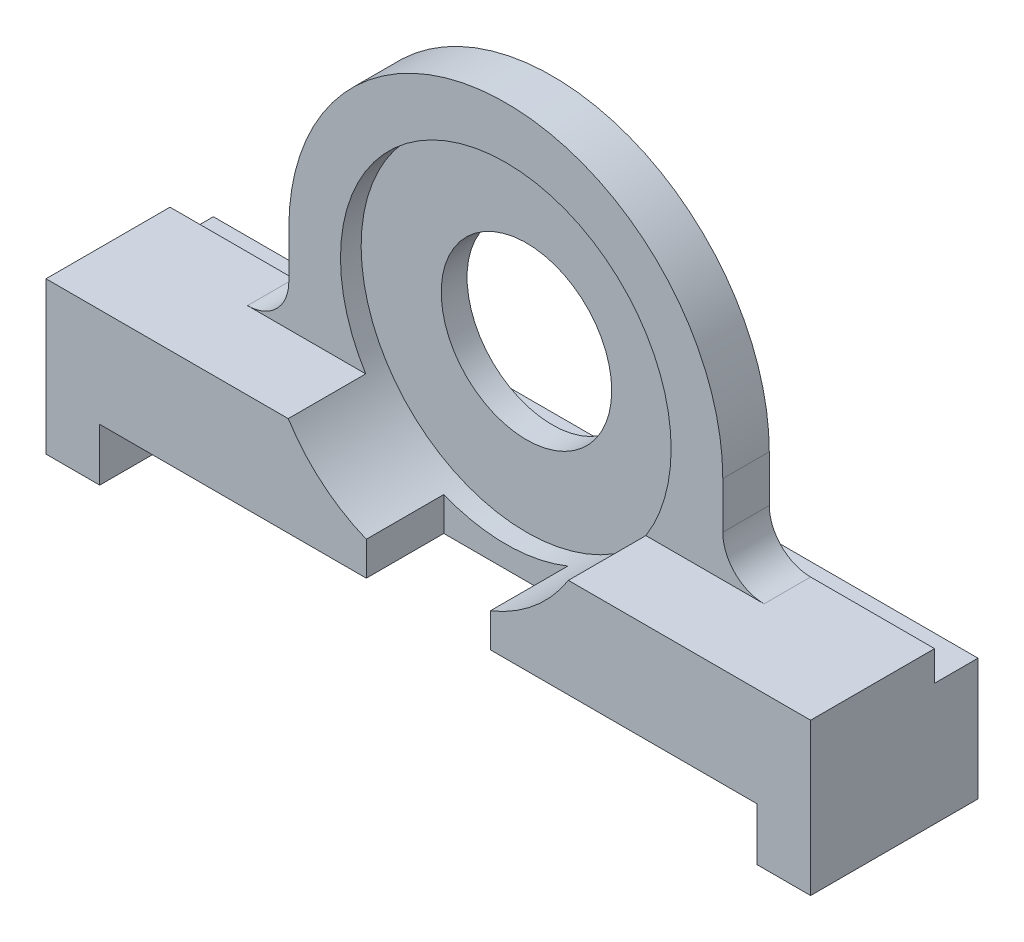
ISO-10303-21;
HEADER;
FILE_DESCRIPTION(('STEP AP214'),'2;1');
FILE_NAME('part.step','',(''),(''),'','','');
FILE_SCHEMA(('AUTOMOTIVE_DESIGN { 1 0 10303 214 1 1 1 1 }'));
ENDSEC;
DATA;
#1=APPLICATION_CONTEXT('core data for automotive mechanical design processes');
#2=APPLICATION_PROTOCOL_DEFINITION('international standard','automotive_design',2000,#1);
#3=PRODUCT_CONTEXT('',#1,'mechanical');
#4=PRODUCT('Part','Part','',(#3));
#5=PRODUCT_RELATED_PRODUCT_CATEGORY('part','',(#4));
#6=PRODUCT_DEFINITION_FORMATION('','',#4);
#7=PRODUCT_DEFINITION_CONTEXT('part definition',#1,'design');
#8=PRODUCT_DEFINITION('design','',#6,#7);
#9=PRODUCT_DEFINITION_SHAPE('','',#8);
#10=(LENGTH_UNIT() NAMED_UNIT(*) SI_UNIT(.MILLI.,.METRE.));
#11=(NAMED_UNIT(*) PLANE_ANGLE_UNIT() SI_UNIT($,.RADIAN.));
#12=(NAMED_UNIT(*) SI_UNIT($,.STERADIAN.) SOLID_ANGLE_UNIT());
#13=UNCERTAINTY_MEASURE_WITH_UNIT(LENGTH_MEASURE(1.E-05),#10,'distance_accuracy_value','');
#14=(GEOMETRIC_REPRESENTATION_CONTEXT(3) GLOBAL_UNCERTAINTY_ASSIGNED_CONTEXT((#13)) GLOBAL_UNIT_ASSIGNED_CONTEXT((#10,
#11,#12)) REPRESENTATION_CONTEXT('',''));
#15=CARTESIAN_POINT('',(0.,0.,0.));
#16=DIRECTION('',(0.,0.,1.));
#17=DIRECTION('',(1.,0.,0.));
#18=AXIS2_PLACEMENT_3D('',#15,#16,#17);
#19=CARTESIAN_POINT('',(0.,23.2,12.));
#20=DIRECTION('',(0.,0.,-1.));
#21=DIRECTION('',(-1.,0.,0.));
#22=AXIS2_PLACEMENT_3D('',#19,#20,#21);
#23=PLANE('',#22);
#24=DIRECTION('',(-1.,0.,0.));
#25=VECTOR('',#24,1.);
#26=CARTESIAN_POINT('',(-21.8,5.1,12.));
#27=LINE('',#26,#25);
#28=CARTESIAN_POINT('',(-6.,5.1,12.));
#29=VERTEX_POINT('',#28);
#30=CARTESIAN_POINT('',(-31.8,5.1,12.));
#31=VERTEX_POINT('',#30);
#32=EDGE_CURVE('E444',#29,#31,#27,.T.);
#33=ORIENTED_EDGE('',*,*,#32,.F.);
#34=DIRECTION('',(0.,-1.,0.));
#35=VECTOR('',#34,1.);
#36=CARTESIAN_POINT('',(-6.,5.1,12.));
#37=LINE('',#36,#35);
#38=CARTESIAN_POINT('',(-6.,8.36760302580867,12.));
#39=VERTEX_POINT('',#38);
#40=EDGE_CURVE('E338',#39,#29,#37,.T.);
#41=ORIENTED_EDGE('',*,*,#40,.F.);
#42=CARTESIAN_POINT('',(0.,23.2,12.));
#43=DIRECTION('',(0.,0.,1.));
#44=DIRECTION('',(1.,0.,0.));
#45=AXIS2_PLACEMENT_3D('',#42,#43,#44);
#46=CIRCLE('',#45,16.);
#47=CARTESIAN_POINT('',(-13.555441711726,14.7,12.));
#48=VERTEX_POINT('',#47);
#49=EDGE_CURVE('E492',#48,#39,#46,.T.);
#50=ORIENTED_EDGE('',*,*,#49,.F.);
#51=DIRECTION('',(-1.,0.,0.));
#52=VECTOR('',#51,1.);
#53=CARTESIAN_POINT('',(-21.,14.7,12.));
#54=LINE('',#53,#52);
#55=CARTESIAN_POINT('',(-37.,14.7,12.));
#56=VERTEX_POINT('',#55);
#57=EDGE_CURVE('E504',#48,#56,#54,.T.);
#58=ORIENTED_EDGE('',*,*,#57,.T.);
#59=DIRECTION('',(0.,-1.,0.));
#60=VECTOR('',#59,1.);
#61=CARTESIAN_POINT('',(-37.,14.7,12.));
#62=LINE('',#61,#60);
#63=CARTESIAN_POINT('',(-37.,0.,12.));
#64=VERTEX_POINT('',#63);
#65=EDGE_CURVE('E506',#56,#64,#62,.T.);
#66=ORIENTED_EDGE('',*,*,#65,.T.);
#67=DIRECTION('',(1.,0.,0.));
#68=VECTOR('',#67,1.);
#69=CARTESIAN_POINT('',(-37.,0.,12.));
#70=LINE('',#69,#68);
#71=CARTESIAN_POINT('',(-31.8,0.,12.));
#72=VERTEX_POINT('',#71);
#73=EDGE_CURVE('E496',#64,#72,#70,.T.);
#74=ORIENTED_EDGE('',*,*,#73,.T.);
#75=DIRECTION('',(0.,-1.,0.));
#76=VECTOR('',#75,1.);
#77=CARTESIAN_POINT('',(-31.8,0.,12.));
#78=LINE('',#77,#76);
#79=EDGE_CURVE('E360',#31,#72,#78,.T.);
#80=ORIENTED_EDGE('',*,*,#79,.F.);
#81=EDGE_LOOP('',(#33,#41,#50,#58,#66,#74,#80));
#82=FACE_BOUND('',#81,.T.);
#83=ADVANCED_FACE('F36',(#82),#23,.F.);
#84=CARTESIAN_POINT('',(21.,23.2,12.));
#85=DIRECTION('',(-1.,0.,0.));
#86=DIRECTION('',(0.,-1.,0.));
#87=AXIS2_PLACEMENT_3D('',#84,#85,#86);
#88=PLANE('',#87);
#89=DIRECTION('',(0.,-1.,0.));
#90=VECTOR('',#89,1.);
#91=CARTESIAN_POINT('',(21.,14.7,4.5));
#92=LINE('',#91,#90);
#93=CARTESIAN_POINT('',(21.,23.2,4.5));
#94=VERTEX_POINT('',#93);
#95=CARTESIAN_POINT('',(21.,18.7,4.5));
#96=VERTEX_POINT('',#95);
#97=EDGE_CURVE('E405',#94,#96,#92,.T.);
#98=ORIENTED_EDGE('',*,*,#97,.T.);
#99=DIRECTION('',(0.,0.,-1.));
#100=VECTOR('',#99,1.);
#101=CARTESIAN_POINT('',(21.,18.7,0.));
#102=LINE('',#101,#100);
#103=CARTESIAN_POINT('',(21.,18.7,0.));
#104=VERTEX_POINT('',#103);
#105=EDGE_CURVE('E559',#96,#104,#102,.T.);
#106=ORIENTED_EDGE('',*,*,#105,.T.);
#107=DIRECTION('',(0.,1.,0.));
#108=VECTOR('',#107,1.);
#109=CARTESIAN_POINT('',(21.,23.2,0.));
#110=LINE('',#109,#108);
#111=CARTESIAN_POINT('',(21.,23.2,0.));
#112=VERTEX_POINT('',#111);
#113=EDGE_CURVE('E513',#104,#112,#110,.T.);
#114=ORIENTED_EDGE('',*,*,#113,.T.);
#115=DIRECTION('',(0.,0.,-1.));
#116=VECTOR('',#115,1.);
#117=CARTESIAN_POINT('',(21.,23.2,12.));
#118=LINE('',#117,#116);
#119=EDGE_CURVE('E531',#94,#112,#118,.T.);
#120=ORIENTED_EDGE('',*,*,#119,.F.);
#121=EDGE_LOOP('',(#98,#106,#114,#120));
#122=FACE_BOUND('',#121,.T.);
#123=ADVANCED_FACE('F595',(#122),#88,.F.);
#124=CARTESIAN_POINT('',(0.,23.2,12.));
#125=DIRECTION('',(0.,0.,-1.));
#126=DIRECTION('',(-1.,0.,0.));
#127=AXIS2_PLACEMENT_3D('',#124,#125,#126);
#128=CYLINDRICAL_SURFACE('',#127,21.);
#129=CARTESIAN_POINT('',(0.,23.2,4.5));
#130=DIRECTION('',(0.,0.,1.));
#131=DIRECTION('',(1.,0.,0.));
#132=AXIS2_PLACEMENT_3D('',#129,#130,#131);
#133=CIRCLE('',#132,21.);
#134=CARTESIAN_POINT('',(-21.,23.2,4.5));
#135=VERTEX_POINT('',#134);
#136=EDGE_CURVE('E379',#135,#94,#133,.F.);
#137=ORIENTED_EDGE('',*,*,#136,.T.);
#138=ORIENTED_EDGE('',*,*,#119,.T.);
#139=CARTESIAN_POINT('',(0.,23.2,0.));
#140=DIRECTION('',(0.,0.,1.));
#141=DIRECTION('',(-1.,0.,0.));
#142=AXIS2_PLACEMENT_3D('',#139,#140,#141);
#143=CIRCLE('',#142,21.);
#144=CARTESIAN_POINT('',(-21.,23.2,0.));
#145=VERTEX_POINT('',#144);
#146=EDGE_CURVE('E515',#112,#145,#143,.T.);
#147=ORIENTED_EDGE('',*,*,#146,.T.);
#148=DIRECTION('',(0.,0.,-1.));
#149=VECTOR('',#148,1.);
#150=CARTESIAN_POINT('',(-21.,23.2,12.));
#151=LINE('',#150,#149);
#152=EDGE_CURVE('E529',#135,#145,#151,.T.);
#153=ORIENTED_EDGE('',*,*,#152,.F.);
#154=EDGE_LOOP('',(#137,#138,#147,#153));
#155=FACE_BOUND('',#154,.T.);
#156=ADVANCED_FACE('F591',(#155),#128,.T.);
#157=CARTESIAN_POINT('',(-21.,14.7,12.));
#158=DIRECTION('',(1.,0.,0.));
#159=DIRECTION('',(0.,0.,-1.));
#160=AXIS2_PLACEMENT_3D('',#157,#158,#159);
#161=PLANE('',#160);
#162=DIRECTION('',(0.,-1.,0.));
#163=VECTOR('',#162,1.);
#164=CARTESIAN_POINT('',(-21.,14.7,0.));
#165=LINE('',#164,#163);
#166=CARTESIAN_POINT('',(-21.,18.7,0.));
#167=VERTEX_POINT('',#166);
#168=EDGE_CURVE('E518',#145,#167,#165,.T.);
#169=ORIENTED_EDGE('',*,*,#168,.T.);
#170=DIRECTION('',(0.,0.,-1.));
#171=VECTOR('',#170,1.);
#172=CARTESIAN_POINT('',(-21.,18.7,4.5));
#173=LINE('',#172,#171);
#174=CARTESIAN_POINT('',(-21.,18.7,4.5));
#175=VERTEX_POINT('',#174);
#176=EDGE_CURVE('E568',#167,#175,#173,.F.);
#177=ORIENTED_EDGE('',*,*,#176,.T.);
#178=DIRECTION('',(0.,1.,0.));
#179=VECTOR('',#178,1.);
#180=CARTESIAN_POINT('',(-21.,23.2,4.5));
#181=LINE('',#180,#179);
#182=EDGE_CURVE('E399',#175,#135,#181,.T.);
#183=ORIENTED_EDGE('',*,*,#182,.T.);
#184=ORIENTED_EDGE('',*,*,#152,.T.);
#185=EDGE_LOOP('',(#169,#177,#183,#184));
#186=FACE_BOUND('',#185,.T.);
#187=ADVANCED_FACE('F582',(#186),#161,.F.);
#188=CARTESIAN_POINT('',(37.,0.,12.));
#189=DIRECTION('',(0.,1.,0.));
#190=DIRECTION('',(-1.,0.,0.));
#191=AXIS2_PLACEMENT_3D('',#188,#189,#190);
#192=PLANE('',#191);
#193=CARTESIAN_POINT('',(-34.,0.,3.));
#194=DIRECTION('',(0.,-1.,0.));
#195=DIRECTION('',(1.,0.,0.));
#196=AXIS2_PLACEMENT_3D('',#193,#194,#195);
#197=CIRCLE('',#196,1.25);
#198=CARTESIAN_POINT('',(-32.75,0.,3.));
#199=VERTEX_POINT('',#198);
#200=EDGE_CURVE('E413',#199,#199,#197,.T.);
#201=ORIENTED_EDGE('',*,*,#200,.F.);
#202=EDGE_LOOP('',(#201));
#203=FACE_BOUND('',#202,.T.);
#204=CARTESIAN_POINT('',(-34.,0.,9.));
#205=DIRECTION('',(0.,-1.,0.));
#206=DIRECTION('',(1.,0.,0.));
#207=AXIS2_PLACEMENT_3D('',#204,#205,#206);
#208=CIRCLE('',#207,1.25);
#209=CARTESIAN_POINT('',(-32.75,0.,9.));
#210=VERTEX_POINT('',#209);
#211=EDGE_CURVE('E412',#210,#210,#208,.T.);
#212=ORIENTED_EDGE('',*,*,#211,.F.);
#213=EDGE_LOOP('',(#212));
#214=FACE_BOUND('',#213,.T.);
#215=DIRECTION('',(1.,0.,0.));
#216=VECTOR('',#215,1.);
#217=CARTESIAN_POINT('',(-21.8,0.,5.));
#218=LINE('',#217,#216);
#219=CARTESIAN_POINT('',(-31.8,0.,5.));
#220=VERTEX_POINT('',#219);
#221=CARTESIAN_POINT('',(-21.8,0.,5.));
#222=VERTEX_POINT('',#221);
#223=EDGE_CURVE('E381',#220,#222,#218,.T.);
#224=ORIENTED_EDGE('',*,*,#223,.F.);
#225=DIRECTION('',(0.,0.,1.));
#226=VECTOR('',#225,1.);
#227=CARTESIAN_POINT('',(-31.8,0.,5.));
#228=LINE('',#227,#226);
#229=EDGE_CURVE('E375',#220,#72,#228,.T.);
#230=ORIENTED_EDGE('',*,*,#229,.T.);
#231=ORIENTED_EDGE('',*,*,#73,.F.);
#232=DIRECTION('',(0.,0.,-1.));
#233=VECTOR('',#232,1.);
#234=CARTESIAN_POINT('',(-37.,0.,12.));
#235=LINE('',#234,#233);
#236=CARTESIAN_POINT('',(-37.,0.,-4.2));
#237=VERTEX_POINT('',#236);
#238=EDGE_CURVE('E508',#64,#237,#235,.T.);
#239=ORIENTED_EDGE('',*,*,#238,.T.);
#240=DIRECTION('',(-1.,0.,0.));
#241=VECTOR('',#240,1.);
#242=CARTESIAN_POINT('',(-37.,0.,-4.2));
#243=LINE('',#242,#241);
#244=CARTESIAN_POINT('',(-33.88,0.,-4.2));
#245=VERTEX_POINT('',#244);
#246=EDGE_CURVE('E327',#245,#237,#243,.T.);
#247=ORIENTED_EDGE('',*,*,#246,.F.);
#248=DIRECTION('',(0.,0.,-1.));
#249=VECTOR('',#248,1.);
#250=CARTESIAN_POINT('',(-33.88,0.,1.));
#251=LINE('',#250,#249);
#252=CARTESIAN_POINT('',(-33.88,0.,1.));
#253=VERTEX_POINT('',#252);
#254=EDGE_CURVE('E483',#253,#245,#251,.T.);
#255=ORIENTED_EDGE('',*,*,#254,.F.);
#256=DIRECTION('',(1.,0.,0.));
#257=VECTOR('',#256,1.);
#258=CARTESIAN_POINT('',(-33.88,0.,1.));
#259=LINE('',#258,#257);
#260=CARTESIAN_POINT('',(-21.8,0.,1.));
#261=VERTEX_POINT('',#260);
#262=EDGE_CURVE('E457',#253,#261,#259,.T.);
#263=ORIENTED_EDGE('',*,*,#262,.T.);
#264=DIRECTION('',(0.,0.,-1.));
#265=VECTOR('',#264,1.);
#266=CARTESIAN_POINT('',(-21.8,0.,12.001));
#267=LINE('',#266,#265);
#268=EDGE_CURVE('E442',#222,#261,#267,.T.);
#269=ORIENTED_EDGE('',*,*,#268,.F.);
#270=EDGE_LOOP('',(#224,#230,#231,#239,#247,#255,#263,#269));
#271=FACE_BOUND('',#270,.T.);
#272=ADVANCED_FACE('F694',(#203,#214,#271),#192,.F.);
#273=CARTESIAN_POINT('',(0.,23.2,0.));
#274=DIRECTION('',(0.,0.,-1.));
#275=DIRECTION('',(-1.,0.,0.));
#276=AXIS2_PLACEMENT_3D('',#273,#274,#275);
#277=PLANE('',#276);
#278=DIRECTION('',(1.,0.,0.));
#279=VECTOR('',#278,1.);
#280=CARTESIAN_POINT('',(37.,11.8,0.));
#281=LINE('',#280,#279);
#282=CARTESIAN_POINT('',(-37.,11.8,0.));
#283=VERTEX_POINT('',#282);
#284=CARTESIAN_POINT('',(37.,11.8,0.));
#285=VERTEX_POINT('',#284);
#286=EDGE_CURVE('E51',#283,#285,#281,.T.);
#287=ORIENTED_EDGE('',*,*,#286,.F.);
#288=DIRECTION('',(0.,-1.,0.));
#289=VECTOR('',#288,1.);
#290=CARTESIAN_POINT('',(-37.,14.7,0.));
#291=LINE('',#290,#289);
#292=CARTESIAN_POINT('',(-37.,14.7,0.));
#293=VERTEX_POINT('',#292);
#294=EDGE_CURVE('E523',#293,#283,#291,.T.);
#295=ORIENTED_EDGE('',*,*,#294,.F.);
#296=DIRECTION('',(-1.,0.,0.));
#297=VECTOR('',#296,1.);
#298=CARTESIAN_POINT('',(-21.,14.7,0.));
#299=LINE('',#298,#297);
#300=CARTESIAN_POINT('',(-25.,14.7,0.));
#301=VERTEX_POINT('',#300);
#302=EDGE_CURVE('E521',#301,#293,#299,.T.);
#303=ORIENTED_EDGE('',*,*,#302,.F.);
#304=CARTESIAN_POINT('',(-25.,18.7,0.));
#305=DIRECTION('',(0.,0.,-1.));
#306=DIRECTION('',(-1.,0.,0.));
#307=AXIS2_PLACEMENT_3D('',#304,#305,#306);
#308=CIRCLE('',#307,4.);
#309=EDGE_CURVE('E44',#301,#167,#308,.F.);
#310=ORIENTED_EDGE('',*,*,#309,.T.);
#311=ORIENTED_EDGE('',*,*,#168,.F.);
#312=ORIENTED_EDGE('',*,*,#146,.F.);
#313=ORIENTED_EDGE('',*,*,#113,.F.);
#314=CARTESIAN_POINT('',(25.,18.7,0.));
#315=DIRECTION('',(0.,0.,-1.));
#316=DIRECTION('',(-1.,0.,0.));
#317=AXIS2_PLACEMENT_3D('',#314,#315,#316);
#318=CIRCLE('',#317,4.);
#319=CARTESIAN_POINT('',(25.,14.7,0.));
#320=VERTEX_POINT('',#319);
#321=EDGE_CURVE('E570',#104,#320,#318,.F.);
#322=ORIENTED_EDGE('',*,*,#321,.T.);
#323=DIRECTION('',(-1.,0.,0.));
#324=VECTOR('',#323,1.);
#325=CARTESIAN_POINT('',(21.,14.7,0.));
#326=LINE('',#325,#324);
#327=CARTESIAN_POINT('',(37.,14.7,0.));
#328=VERTEX_POINT('',#327);
#329=EDGE_CURVE('E510',#328,#320,#326,.T.);
#330=ORIENTED_EDGE('',*,*,#329,.F.);
#331=DIRECTION('',(0.,1.,0.));
#332=VECTOR('',#331,1.);
#333=CARTESIAN_POINT('',(37.,14.7,0.));
#334=LINE('',#333,#332);
#335=EDGE_CURVE('E495',#285,#328,#334,.T.);
#336=ORIENTED_EDGE('',*,*,#335,.F.);
#337=EDGE_LOOP('',(#287,#295,#303,#310,#311,#312,#313,#322,#330,#336));
#338=FACE_BOUND('',#337,.T.);
#339=CARTESIAN_POINT('',(0.,23.2,0.));
#340=DIRECTION('',(0.,0.,1.));
#341=DIRECTION('',(1.,0.,0.));
#342=AXIS2_PLACEMENT_3D('',#339,#340,#341);
#343=CIRCLE('',#342,8.25);
#344=CARTESIAN_POINT('',(8.25,23.2,0.));
#345=VERTEX_POINT('',#344);
#346=EDGE_CURVE('E485',#345,#345,#343,.T.);
#347=ORIENTED_EDGE('',*,*,#346,.T.);
#348=EDGE_LOOP('',(#347));
#349=FACE_BOUND('',#348,.T.);
#350=ADVANCED_FACE('F575',(#338,#349),#277,.T.);
#351=CARTESIAN_POINT('',(34.,0.,9.));
#352=DIRECTION('',(0.,-1.,0.));
#353=DIRECTION('',(-1.,0.,0.));
#354=AXIS2_PLACEMENT_3D('',#351,#352,#353);
#355=CIRCLE('',#354,1.25);
#356=CARTESIAN_POINT('',(32.75,0.,9.));
#357=VERTEX_POINT('',#356);
#358=EDGE_CURVE('E408',#357,#357,#355,.T.);
#359=ORIENTED_EDGE('',*,*,#358,.F.);
#360=EDGE_LOOP('',(#359));
#361=FACE_BOUND('',#360,.T.);
#362=CARTESIAN_POINT('',(34.,0.,3.));
#363=DIRECTION('',(0.,-1.,0.));
#364=DIRECTION('',(-1.,0.,0.));
#365=AXIS2_PLACEMENT_3D('',#362,#363,#364);
#366=CIRCLE('',#365,1.25);
#367=CARTESIAN_POINT('',(32.75,0.,3.));
#368=VERTEX_POINT('',#367);
#369=EDGE_CURVE('E419',#368,#368,#366,.T.);
#370=ORIENTED_EDGE('',*,*,#369,.F.);
#371=EDGE_LOOP('',(#370));
#372=FACE_BOUND('',#371,.T.);
#373=CARTESIAN_POINT('',(31.8,0.,12.));
#374=VERTEX_POINT('',#373);
#375=CARTESIAN_POINT('',(37.,0.,12.));
#376=VERTEX_POINT('',#375);
#377=EDGE_CURVE('E499',#374,#376,#70,.T.);
#378=ORIENTED_EDGE('',*,*,#377,.F.);
#379=DIRECTION('',(0.,0.,1.));
#380=VECTOR('',#379,1.);
#381=CARTESIAN_POINT('',(31.8,0.,5.));
#382=LINE('',#381,#380);
#383=CARTESIAN_POINT('',(31.8,0.,5.));
#384=VERTEX_POINT('',#383);
#385=EDGE_CURVE('E372',#384,#374,#382,.T.);
#386=ORIENTED_EDGE('',*,*,#385,.F.);
#387=DIRECTION('',(1.,0.,0.));
#388=VECTOR('',#387,1.);
#389=CARTESIAN_POINT('',(21.8,0.,5.));
#390=LINE('',#389,#388);
#391=CARTESIAN_POINT('',(21.8,0.,5.));
#392=VERTEX_POINT('',#391);
#393=EDGE_CURVE('E363',#392,#384,#390,.T.);
#394=ORIENTED_EDGE('',*,*,#393,.F.);
#395=DIRECTION('',(0.,0.,-1.));
#396=VECTOR('',#395,1.);
#397=CARTESIAN_POINT('',(21.8,0.,12.001));
#398=LINE('',#397,#396);
#399=CARTESIAN_POINT('',(21.8,0.,1.));
#400=VERTEX_POINT('',#399);
#401=EDGE_CURVE('E445',#392,#400,#398,.T.);
#402=ORIENTED_EDGE('',*,*,#401,.T.);
#403=CARTESIAN_POINT('',(33.88,0.,1.));
#404=VERTEX_POINT('',#403);
#405=EDGE_CURVE('E456',#400,#404,#259,.T.);
#406=ORIENTED_EDGE('',*,*,#405,.T.);
#407=DIRECTION('',(0.,0.,-1.));
#408=VECTOR('',#407,1.);
#409=CARTESIAN_POINT('',(33.88,0.,1.));
#410=LINE('',#409,#408);
#411=CARTESIAN_POINT('',(33.88,0.,-4.2));
#412=VERTEX_POINT('',#411);
#413=EDGE_CURVE('E289',#404,#412,#410,.T.);
#414=ORIENTED_EDGE('',*,*,#413,.T.);
#415=DIRECTION('',(-1.,0.,0.));
#416=VECTOR('',#415,1.);
#417=CARTESIAN_POINT('',(33.88,0.,-4.2));
#418=LINE('',#417,#416);
#419=CARTESIAN_POINT('',(37.,0.,-4.2));
#420=VERTEX_POINT('',#419);
#421=EDGE_CURVE('E286',#420,#412,#418,.T.);
#422=ORIENTED_EDGE('',*,*,#421,.F.);
#423=DIRECTION('',(0.,0.,-1.));
#424=VECTOR('',#423,1.);
#425=CARTESIAN_POINT('',(37.,0.,12.));
#426=LINE('',#425,#424);
#427=EDGE_CURVE('E272',#376,#420,#426,.T.);
#428=ORIENTED_EDGE('',*,*,#427,.F.);
#429=EDGE_LOOP('',(#378,#386,#394,#402,#406,#414,#422,#428));
#430=FACE_BOUND('',#429,.T.);
#431=ADVANCED_FACE('F287',(#361,#372,#430),#192,.F.);
#432=CARTESIAN_POINT('',(6.,8.36760302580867,12.));
#433=VERTEX_POINT('',#432);
#434=CARTESIAN_POINT('',(13.555441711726,14.7,12.));
#435=VERTEX_POINT('',#434);
#436=EDGE_CURVE('E489',#433,#435,#46,.T.);
#437=ORIENTED_EDGE('',*,*,#436,.F.);
#438=DIRECTION('',(0.,1.,0.));
#439=VECTOR('',#438,1.);
#440=CARTESIAN_POINT('',(6.,5.1,12.));
#441=LINE('',#440,#439);
#442=CARTESIAN_POINT('',(6.,5.1,12.));
#443=VERTEX_POINT('',#442);
#444=EDGE_CURVE('E346',#443,#433,#441,.T.);
#445=ORIENTED_EDGE('',*,*,#444,.F.);
#446=CARTESIAN_POINT('',(31.8,5.1,12.));
#447=VERTEX_POINT('',#446);
#448=EDGE_CURVE('E450',#447,#443,#27,.T.);
#449=ORIENTED_EDGE('',*,*,#448,.F.);
#450=DIRECTION('',(0.,1.,0.));
#451=VECTOR('',#450,1.);
#452=CARTESIAN_POINT('',(31.8,0.,12.));
#453=LINE('',#452,#451);
#454=EDGE_CURVE('E364',#374,#447,#453,.T.);
#455=ORIENTED_EDGE('',*,*,#454,.F.);
#456=ORIENTED_EDGE('',*,*,#377,.T.);
#457=DIRECTION('',(0.,1.,0.));
#458=VECTOR('',#457,1.);
#459=CARTESIAN_POINT('',(37.,14.7,12.));
#460=LINE('',#459,#458);
#461=CARTESIAN_POINT('',(37.,14.7,12.));
#462=VERTEX_POINT('',#461);
#463=EDGE_CURVE('E279',#376,#462,#460,.T.);
#464=ORIENTED_EDGE('',*,*,#463,.T.);
#465=DIRECTION('',(-1.,0.,0.));
#466=VECTOR('',#465,1.);
#467=CARTESIAN_POINT('',(21.,14.7,12.));
#468=LINE('',#467,#466);
#469=EDGE_CURVE('E501',#462,#435,#468,.T.);
#470=ORIENTED_EDGE('',*,*,#469,.T.);
#471=EDGE_LOOP('',(#437,#445,#449,#455,#456,#464,#470));
#472=FACE_BOUND('',#471,.T.);
#473=ADVANCED_FACE('F624',(#472),#23,.F.);
#474=CARTESIAN_POINT('',(37.,14.7,12.));
#475=DIRECTION('',(-1.,0.,0.));
#476=DIRECTION('',(0.,0.,1.));
#477=AXIS2_PLACEMENT_3D('',#474,#475,#476);
#478=PLANE('',#477);
#479=ORIENTED_EDGE('',*,*,#427,.T.);
#480=DIRECTION('',(0.,-1.,0.));
#481=VECTOR('',#480,1.);
#482=CARTESIAN_POINT('',(37.,11.8,-4.2));
#483=LINE('',#482,#481);
#484=CARTESIAN_POINT('',(37.,11.8,-4.2));
#485=VERTEX_POINT('',#484);
#486=EDGE_CURVE('E277',#485,#420,#483,.T.);
#487=ORIENTED_EDGE('',*,*,#486,.F.);
#488=DIRECTION('',(0.,0.,1.));
#489=VECTOR('',#488,1.);
#490=CARTESIAN_POINT('',(37.,11.8,-4.2));
#491=LINE('',#490,#489);
#492=EDGE_CURVE('E332',#485,#285,#491,.T.);
#493=ORIENTED_EDGE('',*,*,#492,.T.);
#494=ORIENTED_EDGE('',*,*,#335,.T.);
#495=DIRECTION('',(0.,0.,-1.));
#496=VECTOR('',#495,1.);
#497=CARTESIAN_POINT('',(37.,14.7,12.));
#498=LINE('',#497,#496);
#499=EDGE_CURVE('E283',#462,#328,#498,.T.);
#500=ORIENTED_EDGE('',*,*,#499,.F.);
#501=ORIENTED_EDGE('',*,*,#463,.F.);
#502=EDGE_LOOP('',(#479,#487,#493,#494,#500,#501));
#503=FACE_BOUND('',#502,.T.);
#504=ADVANCED_FACE('F274',(#503),#478,.F.);
#505=CARTESIAN_POINT('',(21.,14.7,12.));
#506=DIRECTION('',(0.,-1.,0.));
#507=DIRECTION('',(1.,0.,0.));
#508=AXIS2_PLACEMENT_3D('',#505,#506,#507);
#509=PLANE('',#508);
#510=ORIENTED_EDGE('',*,*,#329,.T.);
#511=DIRECTION('',(0.,0.,-1.));
#512=VECTOR('',#511,1.);
#513=CARTESIAN_POINT('',(25.,14.7,4.5));
#514=LINE('',#513,#512);
#515=CARTESIAN_POINT('',(25.,14.7,4.5));
#516=VERTEX_POINT('',#515);
#517=EDGE_CURVE('E562',#320,#516,#514,.F.);
#518=ORIENTED_EDGE('',*,*,#517,.T.);
#519=DIRECTION('',(-1.,0.,0.));
#520=VECTOR('',#519,1.);
#521=CARTESIAN_POINT('',(-21.,14.7,4.5));
#522=LINE('',#521,#520);
#523=CARTESIAN_POINT('',(13.555441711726,14.7,4.5));
#524=VERTEX_POINT('',#523);
#525=EDGE_CURVE('E402',#516,#524,#522,.T.);
#526=ORIENTED_EDGE('',*,*,#525,.T.);
#527=DIRECTION('',(0.,0.,-1.));
#528=VECTOR('',#527,1.);
#529=CARTESIAN_POINT('',(13.555441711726,14.7,12.));
#530=LINE('',#529,#528);
#531=EDGE_CURVE('E541',#524,#435,#530,.F.);
#532=ORIENTED_EDGE('',*,*,#531,.T.);
#533=ORIENTED_EDGE('',*,*,#469,.F.);
#534=ORIENTED_EDGE('',*,*,#499,.T.);
#535=EDGE_LOOP('',(#510,#518,#526,#532,#533,#534));
#536=FACE_BOUND('',#535,.T.);
#537=ADVANCED_FACE('F602',(#536),#509,.F.);
#538=CARTESIAN_POINT('',(-21.,14.7,12.));
#539=DIRECTION('',(0.,-1.,0.));
#540=DIRECTION('',(1.,0.,0.));
#541=AXIS2_PLACEMENT_3D('',#538,#539,#540);
#542=PLANE('',#541);
#543=CARTESIAN_POINT('',(-13.555441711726,14.7,4.5));
#544=VERTEX_POINT('',#543);
#545=CARTESIAN_POINT('',(-25.,14.7,4.5));
#546=VERTEX_POINT('',#545);
#547=EDGE_CURVE('E401',#544,#546,#522,.T.);
#548=ORIENTED_EDGE('',*,*,#547,.T.);
#549=DIRECTION('',(0.,0.,-1.));
#550=VECTOR('',#549,1.);
#551=CARTESIAN_POINT('',(-25.,14.7,0.));
#552=LINE('',#551,#550);
#553=EDGE_CURVE('E565',#546,#301,#552,.T.);
#554=ORIENTED_EDGE('',*,*,#553,.T.);
#555=ORIENTED_EDGE('',*,*,#302,.T.);
#556=DIRECTION('',(0.,0.,-1.));
#557=VECTOR('',#556,1.);
#558=CARTESIAN_POINT('',(-37.,14.7,12.));
#559=LINE('',#558,#557);
#560=EDGE_CURVE('E526',#56,#293,#559,.T.);
#561=ORIENTED_EDGE('',*,*,#560,.F.);
#562=ORIENTED_EDGE('',*,*,#57,.F.);
#563=DIRECTION('',(0.,0.,-1.));
#564=VECTOR('',#563,1.);
#565=CARTESIAN_POINT('',(-13.555441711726,14.7,12.));
#566=LINE('',#565,#564);
#567=EDGE_CURVE('E544',#48,#544,#566,.T.);
#568=ORIENTED_EDGE('',*,*,#567,.T.);
#569=EDGE_LOOP('',(#548,#554,#555,#561,#562,#568));
#570=FACE_BOUND('',#569,.T.);
#571=ADVANCED_FACE('F615',(#570),#542,.F.);
#572=CARTESIAN_POINT('',(-37.,14.7,12.));
#573=DIRECTION('',(1.,0.,0.));
#574=DIRECTION('',(0.,0.,-1.));
#575=AXIS2_PLACEMENT_3D('',#572,#573,#574);
#576=PLANE('',#575);
#577=ORIENTED_EDGE('',*,*,#294,.T.);
#578=DIRECTION('',(0.,0.,1.));
#579=VECTOR('',#578,1.);
#580=CARTESIAN_POINT('',(-37.,11.8,-4.2));
#581=LINE('',#580,#579);
#582=CARTESIAN_POINT('',(-37.,11.8,-4.2));
#583=VERTEX_POINT('',#582);
#584=EDGE_CURVE('E335',#583,#283,#581,.T.);
#585=ORIENTED_EDGE('',*,*,#584,.F.);
#586=DIRECTION('',(0.,1.,0.));
#587=VECTOR('',#586,1.);
#588=CARTESIAN_POINT('',(-37.,11.8,-4.2));
#589=LINE('',#588,#587);
#590=EDGE_CURVE('E330',#237,#583,#589,.T.);
#591=ORIENTED_EDGE('',*,*,#590,.F.);
#592=ORIENTED_EDGE('',*,*,#238,.F.);
#593=ORIENTED_EDGE('',*,*,#65,.F.);
#594=ORIENTED_EDGE('',*,*,#560,.T.);
#595=EDGE_LOOP('',(#577,#585,#591,#592,#593,#594));
#596=FACE_BOUND('',#595,.T.);
#597=ADVANCED_FACE('F610',(#596),#576,.F.);
#598=CARTESIAN_POINT('',(0.,23.2,12.));
#599=DIRECTION('',(0.,0.,-1.));
#600=DIRECTION('',(-1.,0.,0.));
#601=AXIS2_PLACEMENT_3D('',#598,#599,#600);
#602=CYLINDRICAL_SURFACE('',#601,16.);
#603=DIRECTION('',(0.,0.,1.));
#604=VECTOR('',#603,1.);
#605=CARTESIAN_POINT('',(-6.,8.36760302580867,-7.9369300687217));
#606=LINE('',#605,#604);
#607=CARTESIAN_POINT('',(-6.,8.36760302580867,4.5));
#608=VERTEX_POINT('',#607);
#609=EDGE_CURVE('E342',#608,#39,#606,.T.);
#610=ORIENTED_EDGE('',*,*,#609,.F.);
#611=CARTESIAN_POINT('',(0.,23.2,4.5));
#612=DIRECTION('',(0.,0.,1.));
#613=DIRECTION('',(1.,0.,0.));
#614=AXIS2_PLACEMENT_3D('',#611,#612,#613);
#615=CIRCLE('',#614,16.);
#616=CARTESIAN_POINT('',(6.,8.36760302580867,4.5));
#617=VERTEX_POINT('',#616);
#618=EDGE_CURVE('E357',#608,#617,#615,.T.);
#619=ORIENTED_EDGE('',*,*,#618,.T.);
#620=DIRECTION('',(0.,0.,1.));
#621=VECTOR('',#620,1.);
#622=CARTESIAN_POINT('',(6.,8.36760302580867,-7.9369300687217));
#623=LINE('',#622,#621);
#624=EDGE_CURVE('E349',#617,#433,#623,.T.);
#625=ORIENTED_EDGE('',*,*,#624,.T.);
#626=ORIENTED_EDGE('',*,*,#436,.T.);
#627=ORIENTED_EDGE('',*,*,#531,.F.);
#628=CARTESIAN_POINT('',(0.,23.2,4.5));
#629=DIRECTION('',(0.,0.,1.));
#630=DIRECTION('',(1.,0.,0.));
#631=AXIS2_PLACEMENT_3D('',#628,#629,#630);
#632=CIRCLE('',#631,16.);
#633=EDGE_CURVE('E538',#524,#544,#632,.T.);
#634=ORIENTED_EDGE('',*,*,#633,.T.);
#635=ORIENTED_EDGE('',*,*,#567,.F.);
#636=ORIENTED_EDGE('',*,*,#49,.T.);
#637=EDGE_LOOP('',(#610,#619,#625,#626,#627,#634,#635,#636));
#638=FACE_BOUND('',#637,.T.);
#639=CARTESIAN_POINT('',(0.,23.2,2.5));
#640=DIRECTION('',(0.,0.,1.));
#641=DIRECTION('',(1.,0.,0.));
#642=AXIS2_PLACEMENT_3D('',#639,#640,#641);
#643=CIRCLE('',#642,16.);
#644=CARTESIAN_POINT('',(16.,23.2,2.5));
#645=VERTEX_POINT('',#644);
#646=EDGE_CURVE('E282',#645,#645,#643,.T.);
#647=ORIENTED_EDGE('',*,*,#646,.F.);
#648=EDGE_LOOP('',(#647));
#649=FACE_BOUND('',#648,.T.);
#650=ADVANCED_FACE('F620',(#638,#649),#602,.F.);
#651=CARTESIAN_POINT('',(0.,23.2,2.5));
#652=DIRECTION('',(0.,0.,1.));
#653=DIRECTION('',(1.,0.,0.));
#654=AXIS2_PLACEMENT_3D('',#651,#652,#653);
#655=PLANE('',#654);
#656=ORIENTED_EDGE('',*,*,#646,.T.);
#657=EDGE_LOOP('',(#656));
#658=FACE_BOUND('',#657,.T.);
#659=CARTESIAN_POINT('',(0.,23.2,2.5));
#660=DIRECTION('',(0.,0.,1.));
#661=DIRECTION('',(1.,0.,0.));
#662=AXIS2_PLACEMENT_3D('',#659,#660,#661);
#663=CIRCLE('',#662,8.25);
#664=CARTESIAN_POINT('',(8.25,23.2,2.5));
#665=VERTEX_POINT('',#664);
#666=EDGE_CURVE('E486',#665,#665,#663,.T.);
#667=ORIENTED_EDGE('',*,*,#666,.F.);
#668=EDGE_LOOP('',(#667));
#669=FACE_BOUND('',#668,.T.);
#670=ADVANCED_FACE('F796',(#658,#669),#655,.T.);
#671=CARTESIAN_POINT('',(0.,23.2,2.5));
#672=DIRECTION('',(0.,0.,-1.));
#673=DIRECTION('',(-1.,0.,0.));
#674=AXIS2_PLACEMENT_3D('',#671,#672,#673);
#675=CYLINDRICAL_SURFACE('',#674,8.25);
#676=ORIENTED_EDGE('',*,*,#666,.T.);
#677=EDGE_LOOP('',(#676));
#678=FACE_BOUND('',#677,.T.);
#679=ORIENTED_EDGE('',*,*,#346,.F.);
#680=EDGE_LOOP('',(#679));
#681=FACE_BOUND('',#680,.T.);
#682=ADVANCED_FACE('F793',(#678,#681),#675,.F.);
#683=CARTESIAN_POINT('',(-33.88,7.2,1.));
#684=DIRECTION('',(1.,0.,0.));
#685=DIRECTION('',(0.,1.,0.));
#686=AXIS2_PLACEMENT_3D('',#683,#684,#685);
#687=PLANE('',#686);
#688=ORIENTED_EDGE('',*,*,#254,.T.);
#689=DIRECTION('',(0.,-1.,0.));
#690=VECTOR('',#689,1.);
#691=CARTESIAN_POINT('',(-33.88,7.2,-4.2));
#692=LINE('',#691,#690);
#693=CARTESIAN_POINT('',(-33.88,7.2,-4.2));
#694=VERTEX_POINT('',#693);
#695=EDGE_CURVE('E324',#694,#245,#692,.T.);
#696=ORIENTED_EDGE('',*,*,#695,.F.);
#697=DIRECTION('',(0.,0.,-1.));
#698=VECTOR('',#697,1.);
#699=CARTESIAN_POINT('',(-33.88,7.2,1.));
#700=LINE('',#699,#698);
#701=CARTESIAN_POINT('',(-33.88,7.2,1.));
#702=VERTEX_POINT('',#701);
#703=EDGE_CURVE('E474',#702,#694,#700,.T.);
#704=ORIENTED_EDGE('',*,*,#703,.F.);
#705=DIRECTION('',(0.,-1.,0.));
#706=VECTOR('',#705,1.);
#707=CARTESIAN_POINT('',(-33.88,7.2,1.));
#708=LINE('',#707,#706);
#709=EDGE_CURVE('E453',#702,#253,#708,.T.);
#710=ORIENTED_EDGE('',*,*,#709,.T.);
#711=EDGE_LOOP('',(#688,#696,#704,#710));
#712=FACE_BOUND('',#711,.T.);
#713=ADVANCED_FACE('F689',(#712),#687,.T.);
#714=CARTESIAN_POINT('',(33.88,7.2,1.));
#715=DIRECTION('',(-1.,0.,0.));
#716=DIRECTION('',(0.,-1.,0.));
#717=AXIS2_PLACEMENT_3D('',#714,#715,#716);
#718=PLANE('',#717);
#719=DIRECTION('',(0.,0.,-1.));
#720=VECTOR('',#719,1.);
#721=CARTESIAN_POINT('',(33.88,7.2,1.));
#722=LINE('',#721,#720);
#723=CARTESIAN_POINT('',(33.88,7.2,1.));
#724=VERTEX_POINT('',#723);
#725=CARTESIAN_POINT('',(33.88,7.2,-4.2));
#726=VERTEX_POINT('',#725);
#727=EDGE_CURVE('E480',#724,#726,#722,.T.);
#728=ORIENTED_EDGE('',*,*,#727,.T.);
#729=DIRECTION('',(0.,1.,0.));
#730=VECTOR('',#729,1.);
#731=CARTESIAN_POINT('',(33.88,0.,-4.2));
#732=LINE('',#731,#730);
#733=EDGE_CURVE('E293',#412,#726,#732,.T.);
#734=ORIENTED_EDGE('',*,*,#733,.F.);
#735=ORIENTED_EDGE('',*,*,#413,.F.);
#736=DIRECTION('',(0.,1.,0.));
#737=VECTOR('',#736,1.);
#738=CARTESIAN_POINT('',(33.88,7.2,1.));
#739=LINE('',#738,#737);
#740=EDGE_CURVE('E460',#404,#724,#739,.T.);
#741=ORIENTED_EDGE('',*,*,#740,.T.);
#742=EDGE_LOOP('',(#728,#734,#735,#741));
#743=FACE_BOUND('',#742,.T.);
#744=ADVANCED_FACE('F655',(#743),#718,.T.);
#745=CARTESIAN_POINT('',(27.,7.2,1.));
#746=DIRECTION('',(0.,-1.,0.));
#747=DIRECTION('',(0.,0.,-1.));
#748=AXIS2_PLACEMENT_3D('',#745,#746,#747);
#749=PLANE('',#748);
#750=DIRECTION('',(0.,0.,-1.));
#751=VECTOR('',#750,1.);
#752=CARTESIAN_POINT('',(27.,7.2,1.));
#753=LINE('',#752,#751);
#754=CARTESIAN_POINT('',(27.,7.2,1.));
#755=VERTEX_POINT('',#754);
#756=CARTESIAN_POINT('',(27.,7.2,-4.2));
#757=VERTEX_POINT('',#756);
#758=EDGE_CURVE('E478',#755,#757,#753,.T.);
#759=ORIENTED_EDGE('',*,*,#758,.T.);
#760=DIRECTION('',(-1.,0.,0.));
#761=VECTOR('',#760,1.);
#762=CARTESIAN_POINT('',(33.88,7.2,-4.2));
#763=LINE('',#762,#761);
#764=EDGE_CURVE('E303',#726,#757,#763,.T.);
#765=ORIENTED_EDGE('',*,*,#764,.F.);
#766=ORIENTED_EDGE('',*,*,#727,.F.);
#767=DIRECTION('',(-1.,0.,0.));
#768=VECTOR('',#767,1.);
#769=CARTESIAN_POINT('',(27.,7.2,1.));
#770=LINE('',#769,#768);
#771=EDGE_CURVE('E462',#724,#755,#770,.T.);
#772=ORIENTED_EDGE('',*,*,#771,.T.);
#773=EDGE_LOOP('',(#759,#765,#766,#772));
#774=FACE_BOUND('',#773,.T.);
#775=ADVANCED_FACE('F659',(#774),#749,.T.);
#776=CARTESIAN_POINT('',(27.,7.2,1.));
#777=DIRECTION('',(-1.,0.,0.));
#778=DIRECTION('',(0.,-1.,0.));
#779=AXIS2_PLACEMENT_3D('',#776,#777,#778);
#780=PLANE('',#779);
#781=DIRECTION('',(0.,1.,0.));
#782=VECTOR('',#781,1.);
#783=CARTESIAN_POINT('',(27.,7.2,1.));
#784=LINE('',#783,#782);
#785=CARTESIAN_POINT('',(27.,8.6,1.));
#786=VERTEX_POINT('',#785);
#787=EDGE_CURVE('E464',#755,#786,#784,.T.);
#788=ORIENTED_EDGE('',*,*,#787,.T.);
#789=DIRECTION('',(0.,0.,-1.));
#790=VECTOR('',#789,1.);
#791=CARTESIAN_POINT('',(27.,8.6,0.));
#792=LINE('',#791,#790);
#793=CARTESIAN_POINT('',(27.,8.6,-4.2));
#794=VERTEX_POINT('',#793);
#795=EDGE_CURVE('E557',#786,#794,#792,.T.);
#796=ORIENTED_EDGE('',*,*,#795,.T.);
#797=DIRECTION('',(0.,1.,0.));
#798=VECTOR('',#797,1.);
#799=CARTESIAN_POINT('',(27.,7.2,-4.2));
#800=LINE('',#799,#798);
#801=EDGE_CURVE('E306',#757,#794,#800,.T.);
#802=ORIENTED_EDGE('',*,*,#801,.F.);
#803=ORIENTED_EDGE('',*,*,#758,.F.);
#804=EDGE_LOOP('',(#788,#796,#802,#803));
#805=FACE_BOUND('',#804,.T.);
#806=ADVANCED_FACE('F662',(#805),#780,.T.);
#807=CARTESIAN_POINT('',(-27.,10.6,1.));
#808=DIRECTION('',(0.,-1.,0.));
#809=DIRECTION('',(0.,0.,-1.));
#810=AXIS2_PLACEMENT_3D('',#807,#808,#809);
#811=PLANE('',#810);
#812=DIRECTION('',(-1.,0.,0.));
#813=VECTOR('',#812,1.);
#814=CARTESIAN_POINT('',(-27.,10.6,1.));
#815=LINE('',#814,#813);
#816=CARTESIAN_POINT('',(25.,10.6,1.));
#817=VERTEX_POINT('',#816);
#818=CARTESIAN_POINT('',(-25.,10.6,1.));
#819=VERTEX_POINT('',#818);
#820=EDGE_CURVE('E467',#817,#819,#815,.T.);
#821=ORIENTED_EDGE('',*,*,#820,.T.);
#822=DIRECTION('',(0.,0.,-1.));
#823=VECTOR('',#822,1.);
#824=CARTESIAN_POINT('',(-25.,10.6,0.));
#825=LINE('',#824,#823);
#826=CARTESIAN_POINT('',(-25.,10.6,-4.2));
#827=VERTEX_POINT('',#826);
#828=EDGE_CURVE('E549',#819,#827,#825,.T.);
#829=ORIENTED_EDGE('',*,*,#828,.T.);
#830=DIRECTION('',(-1.,0.,0.));
#831=VECTOR('',#830,1.);
#832=CARTESIAN_POINT('',(25.,10.6,-4.2));
#833=LINE('',#832,#831);
#834=CARTESIAN_POINT('',(25.,10.6,-4.2));
#835=VERTEX_POINT('',#834);
#836=EDGE_CURVE('E312',#835,#827,#833,.T.);
#837=ORIENTED_EDGE('',*,*,#836,.F.);
#838=DIRECTION('',(0.,0.,-1.));
#839=VECTOR('',#838,1.);
#840=CARTESIAN_POINT('',(25.,10.6,1.));
#841=LINE('',#840,#839);
#842=EDGE_CURVE('E547',#835,#817,#841,.F.);
#843=ORIENTED_EDGE('',*,*,#842,.T.);
#844=EDGE_LOOP('',(#821,#829,#837,#843));
#845=FACE_BOUND('',#844,.T.);
#846=ADVANCED_FACE('F672',(#845),#811,.T.);
#847=CARTESIAN_POINT('',(-27.,7.2,1.));
#848=DIRECTION('',(1.,0.,0.));
#849=DIRECTION('',(0.,1.,0.));
#850=AXIS2_PLACEMENT_3D('',#847,#848,#849);
#851=PLANE('',#850);
#852=DIRECTION('',(0.,0.,-1.));
#853=VECTOR('',#852,1.);
#854=CARTESIAN_POINT('',(-27.,7.2,1.));
#855=LINE('',#854,#853);
#856=CARTESIAN_POINT('',(-27.,7.2,1.));
#857=VERTEX_POINT('',#856);
#858=CARTESIAN_POINT('',(-27.,7.2,-4.2));
#859=VERTEX_POINT('',#858);
#860=EDGE_CURVE('E476',#857,#859,#855,.T.);
#861=ORIENTED_EDGE('',*,*,#860,.T.);
#862=DIRECTION('',(0.,-1.,0.));
#863=VECTOR('',#862,1.);
#864=CARTESIAN_POINT('',(-27.,8.6,-4.2));
#865=LINE('',#864,#863);
#866=CARTESIAN_POINT('',(-27.,8.6,-4.2));
#867=VERTEX_POINT('',#866);
#868=EDGE_CURVE('E318',#867,#859,#865,.T.);
#869=ORIENTED_EDGE('',*,*,#868,.F.);
#870=DIRECTION('',(0.,0.,-1.));
#871=VECTOR('',#870,1.);
#872=CARTESIAN_POINT('',(-27.,8.6,1.));
#873=LINE('',#872,#871);
#874=CARTESIAN_POINT('',(-27.,8.6,1.));
#875=VERTEX_POINT('',#874);
#876=EDGE_CURVE('E551',#867,#875,#873,.F.);
#877=ORIENTED_EDGE('',*,*,#876,.T.);
#878=DIRECTION('',(0.,-1.,0.));
#879=VECTOR('',#878,1.);
#880=CARTESIAN_POINT('',(-27.,7.2,1.));
#881=LINE('',#880,#879);
#882=EDGE_CURVE('E470',#875,#857,#881,.T.);
#883=ORIENTED_EDGE('',*,*,#882,.T.);
#884=EDGE_LOOP('',(#861,#869,#877,#883));
#885=FACE_BOUND('',#884,.T.);
#886=ADVANCED_FACE('F680',(#885),#851,.T.);
#887=CARTESIAN_POINT('',(-27.,7.2,1.));
#888=DIRECTION('',(0.,-1.,0.));
#889=DIRECTION('',(0.,0.,-1.));
#890=AXIS2_PLACEMENT_3D('',#887,#888,#889);
#891=PLANE('',#890);
#892=ORIENTED_EDGE('',*,*,#703,.T.);
#893=DIRECTION('',(-1.,0.,0.));
#894=VECTOR('',#893,1.);
#895=CARTESIAN_POINT('',(-27.,7.2,-4.2));
#896=LINE('',#895,#894);
#897=EDGE_CURVE('E321',#859,#694,#896,.T.);
#898=ORIENTED_EDGE('',*,*,#897,.F.);
#899=ORIENTED_EDGE('',*,*,#860,.F.);
#900=DIRECTION('',(-1.,0.,0.));
#901=VECTOR('',#900,1.);
#902=CARTESIAN_POINT('',(-27.,7.2,1.));
#903=LINE('',#902,#901);
#904=EDGE_CURVE('E472',#857,#702,#903,.T.);
#905=ORIENTED_EDGE('',*,*,#904,.T.);
#906=EDGE_LOOP('',(#892,#898,#899,#905));
#907=FACE_BOUND('',#906,.T.);
#908=ADVANCED_FACE('F684',(#907),#891,.T.);
#909=CARTESIAN_POINT('',(0.,0.,1.));
#910=DIRECTION('',(0.,0.,1.));
#911=DIRECTION('',(1.,0.,0.));
#912=AXIS2_PLACEMENT_3D('',#909,#910,#911);
#913=PLANE('',#912);
#914=ORIENTED_EDGE('',*,*,#882,.F.);
#915=CARTESIAN_POINT('',(-25.,8.6,1.));
#916=DIRECTION('',(0.,0.,1.));
#917=DIRECTION('',(1.,0.,0.));
#918=AXIS2_PLACEMENT_3D('',#915,#916,#917);
#919=CIRCLE('',#918,2.);
#920=EDGE_CURVE('E555',#875,#819,#919,.F.);
#921=ORIENTED_EDGE('',*,*,#920,.T.);
#922=ORIENTED_EDGE('',*,*,#820,.F.);
#923=CARTESIAN_POINT('',(25.,8.6,1.));
#924=DIRECTION('',(0.,0.,1.));
#925=DIRECTION('',(1.,0.,0.));
#926=AXIS2_PLACEMENT_3D('',#923,#924,#925);
#927=CIRCLE('',#926,2.);
#928=EDGE_CURVE('E553',#817,#786,#927,.F.);
#929=ORIENTED_EDGE('',*,*,#928,.T.);
#930=ORIENTED_EDGE('',*,*,#787,.F.);
#931=ORIENTED_EDGE('',*,*,#771,.F.);
#932=ORIENTED_EDGE('',*,*,#740,.F.);
#933=ORIENTED_EDGE('',*,*,#405,.F.);
#934=DIRECTION('',(0.,-1.,0.));
#935=VECTOR('',#934,1.);
#936=CARTESIAN_POINT('',(21.8,0.,1.));
#937=LINE('',#936,#935);
#938=CARTESIAN_POINT('',(21.8,5.1,1.));
#939=VERTEX_POINT('',#938);
#940=EDGE_CURVE('E438',#939,#400,#937,.T.);
#941=ORIENTED_EDGE('',*,*,#940,.F.);
#942=DIRECTION('',(1.,0.,0.));
#943=VECTOR('',#942,1.);
#944=CARTESIAN_POINT('',(-21.8,5.1,1.));
#945=LINE('',#944,#943);
#946=CARTESIAN_POINT('',(-21.8,5.1,1.));
#947=VERTEX_POINT('',#946);
#948=EDGE_CURVE('E435',#947,#939,#945,.T.);
#949=ORIENTED_EDGE('',*,*,#948,.F.);
#950=DIRECTION('',(0.,1.,0.));
#951=VECTOR('',#950,1.);
#952=CARTESIAN_POINT('',(-21.8,0.,1.));
#953=LINE('',#952,#951);
#954=EDGE_CURVE('E430',#261,#947,#953,.T.);
#955=ORIENTED_EDGE('',*,*,#954,.F.);
#956=ORIENTED_EDGE('',*,*,#262,.F.);
#957=ORIENTED_EDGE('',*,*,#709,.F.);
#958=ORIENTED_EDGE('',*,*,#904,.F.);
#959=EDGE_LOOP('',(#914,#921,#922,#929,#930,#931,#932,#933,#941,#949,#955,#956,#957,#958));
#960=FACE_BOUND('',#959,.T.);
#961=ADVANCED_FACE('F649',(#960),#913,.F.);
#962=CARTESIAN_POINT('',(-21.8,0.,12.001));
#963=DIRECTION('',(-1.,0.,0.));
#964=DIRECTION('',(0.,0.,1.));
#965=AXIS2_PLACEMENT_3D('',#962,#963,#964);
#966=PLANE('',#965);
#967=DIRECTION('',(0.,0.,-1.));
#968=VECTOR('',#967,1.);
#969=CARTESIAN_POINT('',(-21.8,5.1,12.001));
#970=LINE('',#969,#968);
#971=CARTESIAN_POINT('',(-21.8,5.1,5.));
#972=VERTEX_POINT('',#971);
#973=EDGE_CURVE('E441',#972,#947,#970,.T.);
#974=ORIENTED_EDGE('',*,*,#973,.F.);
#975=DIRECTION('',(0.,1.,0.));
#976=VECTOR('',#975,1.);
#977=CARTESIAN_POINT('',(-21.8,0.,5.));
#978=LINE('',#977,#976);
#979=EDGE_CURVE('E383',#222,#972,#978,.T.);
#980=ORIENTED_EDGE('',*,*,#979,.F.);
#981=ORIENTED_EDGE('',*,*,#268,.T.);
#982=ORIENTED_EDGE('',*,*,#954,.T.);
#983=EDGE_LOOP('',(#974,#980,#981,#982));
#984=FACE_BOUND('',#983,.T.);
#985=ADVANCED_FACE('F770',(#984),#966,.F.);
#986=CARTESIAN_POINT('',(21.8,0.,12.001));
#987=DIRECTION('',(1.,0.,0.));
#988=DIRECTION('',(0.,0.,-1.));
#989=AXIS2_PLACEMENT_3D('',#986,#987,#988);
#990=PLANE('',#989);
#991=ORIENTED_EDGE('',*,*,#401,.F.);
#992=DIRECTION('',(0.,-1.,0.));
#993=VECTOR('',#992,1.);
#994=CARTESIAN_POINT('',(21.8,0.,5.));
#995=LINE('',#994,#993);
#996=CARTESIAN_POINT('',(21.8,5.1,5.));
#997=VERTEX_POINT('',#996);
#998=EDGE_CURVE('E361',#997,#392,#995,.T.);
#999=ORIENTED_EDGE('',*,*,#998,.F.);
#1000=DIRECTION('',(0.,0.,-1.));
#1001=VECTOR('',#1000,1.);
#1002=CARTESIAN_POINT('',(21.8,5.1,12.001));
#1003=LINE('',#1002,#1001);
#1004=EDGE_CURVE('E447',#997,#939,#1003,.T.);
#1005=ORIENTED_EDGE('',*,*,#1004,.T.);
#1006=ORIENTED_EDGE('',*,*,#940,.T.);
#1007=EDGE_LOOP('',(#991,#999,#1005,#1006));
#1008=FACE_BOUND('',#1007,.T.);
#1009=ADVANCED_FACE('F638',(#1008),#990,.F.);
#1010=CARTESIAN_POINT('',(-21.8,5.1,12.001));
#1011=DIRECTION('',(0.,1.,0.));
#1012=DIRECTION('',(0.,0.,1.));
#1013=AXIS2_PLACEMENT_3D('',#1010,#1011,#1012);
#1014=PLANE('',#1013);
#1015=DIRECTION('',(-1.,0.,0.));
#1016=VECTOR('',#1015,1.);
#1017=CARTESIAN_POINT('',(-6.,5.1,4.5));
#1018=LINE('',#1017,#1016);
#1019=CARTESIAN_POINT('',(6.,5.1,4.5));
#1020=VERTEX_POINT('',#1019);
#1021=CARTESIAN_POINT('',(-6.,5.1,4.5));
#1022=VERTEX_POINT('',#1021);
#1023=EDGE_CURVE('E344',#1020,#1022,#1018,.T.);
#1024=ORIENTED_EDGE('',*,*,#1023,.T.);
#1025=DIRECTION('',(0.,0.,1.));
#1026=VECTOR('',#1025,1.);
#1027=CARTESIAN_POINT('',(-6.,5.1,-7.9369300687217));
#1028=LINE('',#1027,#1026);
#1029=EDGE_CURVE('E59',#1022,#29,#1028,.T.);
#1030=ORIENTED_EDGE('',*,*,#1029,.T.);
#1031=ORIENTED_EDGE('',*,*,#32,.T.);
#1032=DIRECTION('',(0.,0.,1.));
#1033=VECTOR('',#1032,1.);
#1034=CARTESIAN_POINT('',(-31.8,5.1,5.));
#1035=LINE('',#1034,#1033);
#1036=CARTESIAN_POINT('',(-31.8,5.1,5.));
#1037=VERTEX_POINT('',#1036);
#1038=EDGE_CURVE('E391',#1037,#31,#1035,.T.);
#1039=ORIENTED_EDGE('',*,*,#1038,.F.);
#1040=DIRECTION('',(-1.,0.,0.));
#1041=VECTOR('',#1040,1.);
#1042=CARTESIAN_POINT('',(-21.8,5.1,5.));
#1043=LINE('',#1042,#1041);
#1044=EDGE_CURVE('E385',#972,#1037,#1043,.T.);
#1045=ORIENTED_EDGE('',*,*,#1044,.F.);
#1046=ORIENTED_EDGE('',*,*,#973,.T.);
#1047=ORIENTED_EDGE('',*,*,#948,.T.);
#1048=ORIENTED_EDGE('',*,*,#1004,.F.);
#1049=DIRECTION('',(-1.,0.,0.));
#1050=VECTOR('',#1049,1.);
#1051=CARTESIAN_POINT('',(21.8,5.1,5.));
#1052=LINE('',#1051,#1050);
#1053=CARTESIAN_POINT('',(31.8,5.1,5.));
#1054=VERTEX_POINT('',#1053);
#1055=EDGE_CURVE('E370',#1054,#997,#1052,.T.);
#1056=ORIENTED_EDGE('',*,*,#1055,.F.);
#1057=DIRECTION('',(0.,0.,1.));
#1058=VECTOR('',#1057,1.);
#1059=CARTESIAN_POINT('',(31.8,5.1,5.));
#1060=LINE('',#1059,#1058);
#1061=EDGE_CURVE('E376',#1054,#447,#1060,.T.);
#1062=ORIENTED_EDGE('',*,*,#1061,.T.);
#1063=ORIENTED_EDGE('',*,*,#448,.T.);
#1064=DIRECTION('',(0.,0.,1.));
#1065=VECTOR('',#1064,1.);
#1066=CARTESIAN_POINT('',(6.,5.1,-7.9369300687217));
#1067=LINE('',#1066,#1065);
#1068=EDGE_CURVE('E352',#1020,#443,#1067,.T.);
#1069=ORIENTED_EDGE('',*,*,#1068,.F.);
#1070=EDGE_LOOP('',(#1024,#1030,#1031,#1039,#1045,#1046,#1047,#1048,#1056,#1062,#1063,#1069));
#1071=FACE_BOUND('',#1070,.T.);
#1072=ADVANCED_FACE('F640',(#1071),#1014,.F.);
#1073=CARTESIAN_POINT('',(34.,8.99999999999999,3.));
#1074=DIRECTION('',(0.,-1.,0.));
#1075=DIRECTION('',(1.,0.,0.));
#1076=AXIS2_PLACEMENT_3D('',#1073,#1074,#1075);
#1077=CYLINDRICAL_SURFACE('',#1076,1.25);
#1078=CARTESIAN_POINT('',(34.,8.99999999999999,3.));
#1079=DIRECTION('',(0.,-1.,0.));
#1080=DIRECTION('',(-1.,0.,0.));
#1081=AXIS2_PLACEMENT_3D('',#1078,#1079,#1080);
#1082=CIRCLE('',#1081,1.25);
#1083=CARTESIAN_POINT('',(32.75,8.99999999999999,3.));
#1084=VERTEX_POINT('',#1083);
#1085=EDGE_CURVE('E416',#1084,#1084,#1082,.T.);
#1086=ORIENTED_EDGE('',*,*,#1085,.F.);
#1087=EDGE_LOOP('',(#1086));
#1088=FACE_BOUND('',#1087,.T.);
#1089=ORIENTED_EDGE('',*,*,#369,.T.);
#1090=EDGE_LOOP('',(#1089));
#1091=FACE_BOUND('',#1090,.T.);
#1092=ADVANCED_FACE('F773',(#1088,#1091),#1077,.F.);
#1093=CARTESIAN_POINT('',(34.,8.99999999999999,3.));
#1094=DIRECTION('',(0.,1.,0.));
#1095=DIRECTION('',(-1.,0.,0.));
#1096=AXIS2_PLACEMENT_3D('',#1093,#1094,#1095);
#1097=PLANE('',#1096);
#1098=ORIENTED_EDGE('',*,*,#1085,.T.);
#1099=EDGE_LOOP('',(#1098));
#1100=FACE_BOUND('',#1099,.T.);
#1101=ADVANCED_FACE('F1109',(#1100),#1097,.F.);
#1102=CARTESIAN_POINT('',(34.,8.99999999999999,9.));
#1103=DIRECTION('',(0.,-1.,0.));
#1104=DIRECTION('',(1.,0.,0.));
#1105=AXIS2_PLACEMENT_3D('',#1102,#1103,#1104);
#1106=CYLINDRICAL_SURFACE('',#1105,1.25);
#1107=CARTESIAN_POINT('',(34.,8.99999999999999,9.));
#1108=DIRECTION('',(0.,-1.,0.));
#1109=DIRECTION('',(-1.,0.,0.));
#1110=AXIS2_PLACEMENT_3D('',#1107,#1108,#1109);
#1111=CIRCLE('',#1110,1.25);
#1112=CARTESIAN_POINT('',(32.75,8.99999999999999,9.));
#1113=VERTEX_POINT('',#1112);
#1114=EDGE_CURVE('E422',#1113,#1113,#1111,.T.);
#1115=ORIENTED_EDGE('',*,*,#1114,.F.);
#1116=EDGE_LOOP('',(#1115));
#1117=FACE_BOUND('',#1116,.T.);
#1118=ORIENTED_EDGE('',*,*,#358,.T.);
#1119=EDGE_LOOP('',(#1118));
#1120=FACE_BOUND('',#1119,.T.);
#1121=ADVANCED_FACE('F762',(#1117,#1120),#1106,.F.);
#1122=CARTESIAN_POINT('',(34.,8.99999999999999,9.));
#1123=DIRECTION('',(0.,1.,0.));
#1124=DIRECTION('',(-1.,0.,0.));
#1125=AXIS2_PLACEMENT_3D('',#1122,#1123,#1124);
#1126=PLANE('',#1125);
#1127=ORIENTED_EDGE('',*,*,#1114,.T.);
#1128=EDGE_LOOP('',(#1127));
#1129=FACE_BOUND('',#1128,.T.);
#1130=ADVANCED_FACE('F752',(#1129),#1126,.F.);
#1131=CARTESIAN_POINT('',(-34.,9.00000000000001,9.));
#1132=DIRECTION('',(0.,-1.,0.));
#1133=DIRECTION('',(1.,0.,0.));
#1134=AXIS2_PLACEMENT_3D('',#1131,#1132,#1133);
#1135=CYLINDRICAL_SURFACE('',#1134,1.25);
#1136=CARTESIAN_POINT('',(-34.,9.00000000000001,9.));
#1137=DIRECTION('',(0.,-1.,0.));
#1138=DIRECTION('',(1.,0.,0.));
#1139=AXIS2_PLACEMENT_3D('',#1136,#1137,#1138);
#1140=CIRCLE('',#1139,1.25);
#1141=CARTESIAN_POINT('',(-32.75,9.00000000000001,9.));
#1142=VERTEX_POINT('',#1141);
#1143=EDGE_CURVE('E427',#1142,#1142,#1140,.T.);
#1144=ORIENTED_EDGE('',*,*,#1143,.F.);
#1145=EDGE_LOOP('',(#1144));
#1146=FACE_BOUND('',#1145,.T.);
#1147=ORIENTED_EDGE('',*,*,#211,.T.);
#1148=EDGE_LOOP('',(#1147));
#1149=FACE_BOUND('',#1148,.T.);
#1150=ADVANCED_FACE('F749',(#1146,#1149),#1135,.F.);
#1151=CARTESIAN_POINT('',(-34.,9.00000000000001,9.));
#1152=DIRECTION('',(0.,-1.,0.));
#1153=DIRECTION('',(1.,0.,0.));
#1154=AXIS2_PLACEMENT_3D('',#1151,#1152,#1153);
#1155=PLANE('',#1154);
#1156=ORIENTED_EDGE('',*,*,#1143,.T.);
#1157=EDGE_LOOP('',(#1156));
#1158=FACE_BOUND('',#1157,.T.);
#1159=ADVANCED_FACE('F751',(#1158),#1155,.T.);
#1160=CARTESIAN_POINT('',(-34.,9.00000000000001,3.));
#1161=DIRECTION('',(0.,-1.,0.));
#1162=DIRECTION('',(1.,0.,0.));
#1163=AXIS2_PLACEMENT_3D('',#1160,#1161,#1162);
#1164=CYLINDRICAL_SURFACE('',#1163,1.25);
#1165=CARTESIAN_POINT('',(-34.,9.00000000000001,3.));
#1166=DIRECTION('',(0.,-1.,0.));
#1167=DIRECTION('',(1.,0.,0.));
#1168=AXIS2_PLACEMENT_3D('',#1165,#1166,#1167);
#1169=CIRCLE('',#1168,1.25);
#1170=CARTESIAN_POINT('',(-32.75,9.00000000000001,3.));
#1171=VERTEX_POINT('',#1170);
#1172=EDGE_CURVE('E409',#1171,#1171,#1169,.T.);
#1173=ORIENTED_EDGE('',*,*,#1172,.F.);
#1174=EDGE_LOOP('',(#1173));
#1175=FACE_BOUND('',#1174,.T.);
#1176=ORIENTED_EDGE('',*,*,#200,.T.);
#1177=EDGE_LOOP('',(#1176));
#1178=FACE_BOUND('',#1177,.T.);
#1179=ADVANCED_FACE('F759',(#1175,#1178),#1164,.F.);
#1180=CARTESIAN_POINT('',(-34.,9.00000000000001,3.));
#1181=DIRECTION('',(0.,-1.,0.));
#1182=DIRECTION('',(1.,0.,0.));
#1183=AXIS2_PLACEMENT_3D('',#1180,#1181,#1182);
#1184=PLANE('',#1183);
#1185=ORIENTED_EDGE('',*,*,#1172,.T.);
#1186=EDGE_LOOP('',(#1185));
#1187=FACE_BOUND('',#1186,.T.);
#1188=ADVANCED_FACE('F832',(#1187),#1184,.T.);
#1189=CARTESIAN_POINT('',(0.,23.2,4.5));
#1190=DIRECTION('',(0.,0.,1.));
#1191=DIRECTION('',(1.,0.,0.));
#1192=AXIS2_PLACEMENT_3D('',#1189,#1190,#1191);
#1193=PLANE('',#1192);
#1194=ORIENTED_EDGE('',*,*,#525,.F.);
#1195=CARTESIAN_POINT('',(25.,18.7,4.5));
#1196=DIRECTION('',(0.,0.,1.));
#1197=DIRECTION('',(1.,0.,0.));
#1198=AXIS2_PLACEMENT_3D('',#1195,#1196,#1197);
#1199=CIRCLE('',#1198,4.);
#1200=EDGE_CURVE('E572',#516,#96,#1199,.F.);
#1201=ORIENTED_EDGE('',*,*,#1200,.T.);
#1202=ORIENTED_EDGE('',*,*,#97,.F.);
#1203=ORIENTED_EDGE('',*,*,#136,.F.);
#1204=ORIENTED_EDGE('',*,*,#182,.F.);
#1205=CARTESIAN_POINT('',(-25.,18.7,4.5));
#1206=DIRECTION('',(0.,0.,1.));
#1207=DIRECTION('',(1.,0.,0.));
#1208=AXIS2_PLACEMENT_3D('',#1205,#1206,#1207);
#1209=CIRCLE('',#1208,4.);
#1210=EDGE_CURVE('E13',#175,#546,#1209,.F.);
#1211=ORIENTED_EDGE('',*,*,#1210,.T.);
#1212=ORIENTED_EDGE('',*,*,#547,.F.);
#1213=ORIENTED_EDGE('',*,*,#633,.F.);
#1214=EDGE_LOOP('',(#1194,#1201,#1202,#1203,#1204,#1211,#1212,#1213));
#1215=FACE_BOUND('',#1214,.T.);
#1216=ADVANCED_FACE('F587',(#1215),#1193,.T.);
#1217=CARTESIAN_POINT('',(-25.,8.6,1.));
#1218=DIRECTION('',(0.,0.,1.));
#1219=DIRECTION('',(1.,0.,0.));
#1220=AXIS2_PLACEMENT_3D('',#1217,#1218,#1219);
#1221=CYLINDRICAL_SURFACE('',#1220,2.);
#1222=ORIENTED_EDGE('',*,*,#920,.F.);
#1223=ORIENTED_EDGE('',*,*,#876,.F.);
#1224=CARTESIAN_POINT('',(-25.,8.6,-4.2));
#1225=DIRECTION('',(0.,0.,1.));
#1226=DIRECTION('',(-1.,0.,0.));
#1227=AXIS2_PLACEMENT_3D('',#1224,#1225,#1226);
#1228=CIRCLE('',#1227,2.);
#1229=EDGE_CURVE('E315',#827,#867,#1228,.T.);
#1230=ORIENTED_EDGE('',*,*,#1229,.F.);
#1231=ORIENTED_EDGE('',*,*,#828,.F.);
#1232=EDGE_LOOP('',(#1222,#1223,#1230,#1231));
#1233=FACE_BOUND('',#1232,.T.);
#1234=ADVANCED_FACE('F676',(#1233),#1221,.F.);
#1235=CARTESIAN_POINT('',(25.,8.6,1.));
#1236=DIRECTION('',(0.,0.,1.));
#1237=DIRECTION('',(1.,0.,0.));
#1238=AXIS2_PLACEMENT_3D('',#1235,#1236,#1237);
#1239=CYLINDRICAL_SURFACE('',#1238,2.);
#1240=ORIENTED_EDGE('',*,*,#928,.F.);
#1241=ORIENTED_EDGE('',*,*,#842,.F.);
#1242=CARTESIAN_POINT('',(25.,8.6,-4.2));
#1243=DIRECTION('',(0.,0.,1.));
#1244=DIRECTION('',(-1.,0.,0.));
#1245=AXIS2_PLACEMENT_3D('',#1242,#1243,#1244);
#1246=CIRCLE('',#1245,2.);
#1247=EDGE_CURVE('E309',#794,#835,#1246,.T.);
#1248=ORIENTED_EDGE('',*,*,#1247,.F.);
#1249=ORIENTED_EDGE('',*,*,#795,.F.);
#1250=EDGE_LOOP('',(#1240,#1241,#1248,#1249));
#1251=FACE_BOUND('',#1250,.T.);
#1252=ADVANCED_FACE('F667',(#1251),#1239,.F.);
#1253=CARTESIAN_POINT('',(25.,18.7,12.));
#1254=DIRECTION('',(0.,0.,1.));
#1255=DIRECTION('',(1.,0.,0.));
#1256=AXIS2_PLACEMENT_3D('',#1253,#1254,#1255);
#1257=CYLINDRICAL_SURFACE('',#1256,4.);
#1258=ORIENTED_EDGE('',*,*,#1200,.F.);
#1259=ORIENTED_EDGE('',*,*,#517,.F.);
#1260=ORIENTED_EDGE('',*,*,#321,.F.);
#1261=ORIENTED_EDGE('',*,*,#105,.F.);
#1262=EDGE_LOOP('',(#1258,#1259,#1260,#1261));
#1263=FACE_BOUND('',#1262,.T.);
#1264=ADVANCED_FACE('F599',(#1263),#1257,.F.);
#1265=CARTESIAN_POINT('',(-25.,18.7,12.));
#1266=DIRECTION('',(0.,0.,1.));
#1267=DIRECTION('',(1.,0.,0.));
#1268=AXIS2_PLACEMENT_3D('',#1265,#1266,#1267);
#1269=CYLINDRICAL_SURFACE('',#1268,4.);
#1270=ORIENTED_EDGE('',*,*,#1210,.F.);
#1271=ORIENTED_EDGE('',*,*,#176,.F.);
#1272=ORIENTED_EDGE('',*,*,#309,.F.);
#1273=ORIENTED_EDGE('',*,*,#553,.F.);
#1274=EDGE_LOOP('',(#1270,#1271,#1272,#1273));
#1275=FACE_BOUND('',#1274,.T.);
#1276=ADVANCED_FACE('F38',(#1275),#1269,.F.);
#1277=CARTESIAN_POINT('',(-31.8,0.,5.));
#1278=DIRECTION('',(-1.,0.,0.));
#1279=DIRECTION('',(0.,0.,1.));
#1280=AXIS2_PLACEMENT_3D('',#1277,#1278,#1279);
#1281=PLANE('',#1280);
#1282=ORIENTED_EDGE('',*,*,#79,.T.);
#1283=ORIENTED_EDGE('',*,*,#229,.F.);
#1284=DIRECTION('',(0.,-1.,0.));
#1285=VECTOR('',#1284,1.);
#1286=CARTESIAN_POINT('',(-31.8,0.,5.));
#1287=LINE('',#1286,#1285);
#1288=EDGE_CURVE('E388',#1037,#220,#1287,.T.);
#1289=ORIENTED_EDGE('',*,*,#1288,.F.);
#1290=ORIENTED_EDGE('',*,*,#1038,.T.);
#1291=EDGE_LOOP('',(#1282,#1283,#1289,#1290));
#1292=FACE_BOUND('',#1291,.T.);
#1293=ADVANCED_FACE('F853',(#1292),#1281,.F.);
#1294=CARTESIAN_POINT('',(0.,0.,5.));
#1295=DIRECTION('',(0.,0.,-1.));
#1296=DIRECTION('',(-1.,0.,0.));
#1297=AXIS2_PLACEMENT_3D('',#1294,#1295,#1296);
#1298=PLANE('',#1297);
#1299=ORIENTED_EDGE('',*,*,#223,.T.);
#1300=ORIENTED_EDGE('',*,*,#979,.T.);
#1301=ORIENTED_EDGE('',*,*,#1044,.T.);
#1302=ORIENTED_EDGE('',*,*,#1288,.T.);
#1303=EDGE_LOOP('',(#1299,#1300,#1301,#1302));
#1304=FACE_BOUND('',#1303,.T.);
#1305=ADVANCED_FACE('F876',(#1304),#1298,.F.);
#1306=CARTESIAN_POINT('',(31.8,0.,5.));
#1307=DIRECTION('',(1.,0.,0.));
#1308=DIRECTION('',(0.,0.,-1.));
#1309=AXIS2_PLACEMENT_3D('',#1306,#1307,#1308);
#1310=PLANE('',#1309);
#1311=ORIENTED_EDGE('',*,*,#454,.T.);
#1312=ORIENTED_EDGE('',*,*,#1061,.F.);
#1313=DIRECTION('',(0.,1.,0.));
#1314=VECTOR('',#1313,1.);
#1315=CARTESIAN_POINT('',(31.8,0.,5.));
#1316=LINE('',#1315,#1314);
#1317=EDGE_CURVE('E367',#384,#1054,#1316,.T.);
#1318=ORIENTED_EDGE('',*,*,#1317,.F.);
#1319=ORIENTED_EDGE('',*,*,#385,.T.);
#1320=EDGE_LOOP('',(#1311,#1312,#1318,#1319));
#1321=FACE_BOUND('',#1320,.T.);
#1322=ADVANCED_FACE('F631',(#1321),#1310,.F.);
#1323=CARTESIAN_POINT('',(0.,0.,5.));
#1324=DIRECTION('',(0.,0.,-1.));
#1325=DIRECTION('',(-1.,0.,0.));
#1326=AXIS2_PLACEMENT_3D('',#1323,#1324,#1325);
#1327=PLANE('',#1326);
#1328=ORIENTED_EDGE('',*,*,#998,.T.);
#1329=ORIENTED_EDGE('',*,*,#393,.T.);
#1330=ORIENTED_EDGE('',*,*,#1317,.T.);
#1331=ORIENTED_EDGE('',*,*,#1055,.T.);
#1332=EDGE_LOOP('',(#1328,#1329,#1330,#1331));
#1333=FACE_BOUND('',#1332,.T.);
#1334=ADVANCED_FACE('F634',(#1333),#1327,.F.);
#1335=CARTESIAN_POINT('',(-6.,5.1,-7.9369300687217));
#1336=DIRECTION('',(-1.,0.,0.));
#1337=DIRECTION('',(0.,-1.,0.));
#1338=AXIS2_PLACEMENT_3D('',#1335,#1336,#1337);
#1339=PLANE('',#1338);
#1340=DIRECTION('',(0.,1.,0.));
#1341=VECTOR('',#1340,1.);
#1342=CARTESIAN_POINT('',(-6.,5.1,4.5));
#1343=LINE('',#1342,#1341);
#1344=EDGE_CURVE('E341',#1022,#608,#1343,.T.);
#1345=ORIENTED_EDGE('',*,*,#1344,.T.);
#1346=ORIENTED_EDGE('',*,*,#609,.T.);
#1347=ORIENTED_EDGE('',*,*,#40,.T.);
#1348=ORIENTED_EDGE('',*,*,#1029,.F.);
#1349=EDGE_LOOP('',(#1345,#1346,#1347,#1348));
#1350=FACE_BOUND('',#1349,.T.);
#1351=ADVANCED_FACE('F701',(#1350),#1339,.F.);
#1352=CARTESIAN_POINT('',(6.,5.1,-7.9369300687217));
#1353=DIRECTION('',(1.,0.,0.));
#1354=DIRECTION('',(0.,1.,0.));
#1355=AXIS2_PLACEMENT_3D('',#1352,#1353,#1354);
#1356=PLANE('',#1355);
#1357=DIRECTION('',(0.,-1.,0.));
#1358=VECTOR('',#1357,1.);
#1359=CARTESIAN_POINT('',(6.,5.1,4.5));
#1360=LINE('',#1359,#1358);
#1361=EDGE_CURVE('E339',#617,#1020,#1360,.T.);
#1362=ORIENTED_EDGE('',*,*,#1361,.T.);
#1363=ORIENTED_EDGE('',*,*,#1068,.T.);
#1364=ORIENTED_EDGE('',*,*,#444,.T.);
#1365=ORIENTED_EDGE('',*,*,#624,.F.);
#1366=EDGE_LOOP('',(#1362,#1363,#1364,#1365));
#1367=FACE_BOUND('',#1366,.T.);
#1368=ADVANCED_FACE('F707',(#1367),#1356,.F.);
#1369=CARTESIAN_POINT('',(0.,23.2,4.5));
#1370=DIRECTION('',(0.,0.,1.));
#1371=DIRECTION('',(1.,0.,0.));
#1372=AXIS2_PLACEMENT_3D('',#1369,#1370,#1371);
#1373=PLANE('',#1372);
#1374=ORIENTED_EDGE('',*,*,#1344,.F.);
#1375=ORIENTED_EDGE('',*,*,#1023,.F.);
#1376=ORIENTED_EDGE('',*,*,#1361,.F.);
#1377=ORIENTED_EDGE('',*,*,#618,.F.);
#1378=EDGE_LOOP('',(#1374,#1375,#1376,#1377));
#1379=FACE_BOUND('',#1378,.T.);
#1380=ADVANCED_FACE('F704',(#1379),#1373,.T.);
#1381=CARTESIAN_POINT('',(37.,11.8,-4.2));
#1382=DIRECTION('',(0.,-1.,0.));
#1383=DIRECTION('',(0.,0.,-1.));
#1384=AXIS2_PLACEMENT_3D('',#1381,#1382,#1383);
#1385=PLANE('',#1384);
#1386=ORIENTED_EDGE('',*,*,#286,.T.);
#1387=ORIENTED_EDGE('',*,*,#492,.F.);
#1388=DIRECTION('',(1.,0.,0.));
#1389=VECTOR('',#1388,1.);
#1390=CARTESIAN_POINT('',(37.,11.8,-4.2));
#1391=LINE('',#1390,#1389);
#1392=EDGE_CURVE('E297',#583,#485,#1391,.T.);
#1393=ORIENTED_EDGE('',*,*,#1392,.F.);
#1394=ORIENTED_EDGE('',*,*,#584,.T.);
#1395=EDGE_LOOP('',(#1386,#1387,#1393,#1394));
#1396=FACE_BOUND('',#1395,.T.);
#1397=ADVANCED_FACE('F606',(#1396),#1385,.F.);
#1398=CARTESIAN_POINT('',(25.,8.6,-4.2));
#1399=DIRECTION('',(0.,0.,-1.));
#1400=DIRECTION('',(-1.,0.,0.));
#1401=AXIS2_PLACEMENT_3D('',#1398,#1399,#1400);
#1402=PLANE('',#1401);
#1403=ORIENTED_EDGE('',*,*,#486,.T.);
#1404=ORIENTED_EDGE('',*,*,#421,.T.);
#1405=ORIENTED_EDGE('',*,*,#733,.T.);
#1406=ORIENTED_EDGE('',*,*,#764,.T.);
#1407=ORIENTED_EDGE('',*,*,#801,.T.);
#1408=ORIENTED_EDGE('',*,*,#1247,.T.);
#1409=ORIENTED_EDGE('',*,*,#836,.T.);
#1410=ORIENTED_EDGE('',*,*,#1229,.T.);
#1411=ORIENTED_EDGE('',*,*,#868,.T.);
#1412=ORIENTED_EDGE('',*,*,#897,.T.);
#1413=ORIENTED_EDGE('',*,*,#695,.T.);
#1414=ORIENTED_EDGE('',*,*,#246,.T.);
#1415=ORIENTED_EDGE('',*,*,#590,.T.);
#1416=ORIENTED_EDGE('',*,*,#1392,.T.);
#1417=EDGE_LOOP('',(#1403,#1404,#1405,#1406,#1407,#1408,#1409,#1410,#1411,#1412,#1413,#1414,
#1415,#1416));
#1418=FACE_BOUND('',#1417,.T.);
#1419=ADVANCED_FACE('F295',(#1418),#1402,.T.);
#1420=CLOSED_SHELL('',(#83,#123,#156,#187,#272,#350,#431,#473,#504,#537,#571,#597,#650,#670,
#682,#713,#744,#775,#806,#846,#886,#908,#961,#985,#1009,#1072,#1092,#1101,#1121,#1130,#1150,
#1159,#1179,#1188,#1216,#1234,#1252,#1264,#1276,#1293,#1305,#1322,#1334,#1351,#1368,#1380,#1397,#1419));
#1421=MANIFOLD_SOLID_BREP('B2',#1420);
#1422=ADVANCED_BREP_SHAPE_REPRESENTATION('',(#18,#1421),#14);
#1423=SHAPE_DEFINITION_REPRESENTATION(#9,#1422);
ENDSEC;
END-ISO-10303-21;
